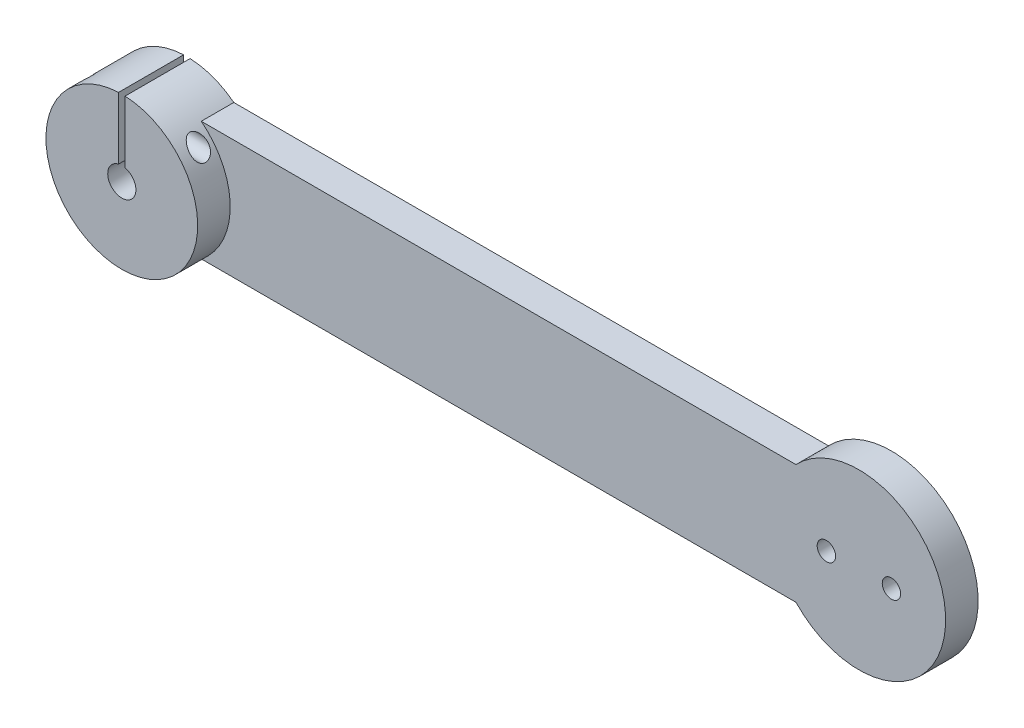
from build123d import *

# Parameters (mm, degrees)
SKETCH_1_W                         = 130
SKETCH_1_H                         = 22
ARM_WEB_L130_W22_T6_DEPTH          = 6
SKETCH_2_R                         = 14
SPLIT_CLAMP_HUB_DEPTH              = 12
SKETCH_3_R                         = 16
WRIST_END_R16_DEPTH                = 6
SHAFT_D5P2_AND_WRIST_M3_DEPTH      = 148.363496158
SHAFT_D5P2_AND_WRIST_M3_DEPTH_BACK = 148.363496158
SKETCH_4_R                         = 2.6
SKETCH_4_R_2                       = 1.7
CLAMP_SPLIT_1P2_DEPTH              = 148.363496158
CLAMP_SPLIT_1P2_DEPTH_BACK         = 148.363496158
SKETCH_5_W                         = 1.2
SKETCH_5_H                         = 12.8
CLAMP_CROSSBOLT_M3_DEPTH           = 148.363496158
CLAMP_CROSSBOLT_M3_DEPTH_BACK      = 148.363496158
SKETCH_6_R                         = 1.7


with BuildPart() as part:
    # Sketch 1 → Arm_web_L130_W22_T6 (new body)
    with BuildSketch(Plane.XY):
        with Locations((65, 0)):
            Rectangle(SKETCH_1_W, SKETCH_1_H)
    extrude(amount=ARM_WEB_L130_W22_T6_DEPTH)

    # Sketch 2 → Split_clamp_hub (add)
    with BuildSketch(Plane.XY):
        with Locations(Location((0, 0, 0), (0, 0, 308.213210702))):
            Circle(SKETCH_2_R)
    extrude(amount=SPLIT_CLAMP_HUB_DEPTH)

    # Sketch 3 → Wrist_end_R16 (add)
    with BuildSketch(Plane.XY):
        with Locations((130, 0)):
            Circle(SKETCH_3_R)
    extrude(amount=WRIST_END_R16_DEPTH)

    # Sketch 4 → Shaft_D5p2_and_wrist_M3 (cut, two sides: drawn at the far end of the back side and taken through both)
    with BuildSketch(Plane.XY.offset(-SHAFT_D5P2_AND_WRIST_M3_DEPTH_BACK)):
        Circle(SKETCH_4_R)
        with Locations((124, 0)):
            Circle(SKETCH_4_R_2)
        with Locations((136, 0)):
            Circle(SKETCH_4_R_2)
    extrude(amount=SHAFT_D5P2_AND_WRIST_M3_DEPTH + SHAFT_D5P2_AND_WRIST_M3_DEPTH_BACK, mode=Mode.SUBTRACT)

    # Sketch 5 → Clamp_split_1p2 (cut, two sides: drawn at the far end of the back side and taken through both)
    with BuildSketch(Plane.XY.offset(-CLAMP_SPLIT_1P2_DEPTH_BACK)):
        with Locations((0, 8.6)):
            Rectangle(SKETCH_5_W, SKETCH_5_H)
    extrude(amount=CLAMP_SPLIT_1P2_DEPTH + CLAMP_SPLIT_1P2_DEPTH_BACK, mode=Mode.SUBTRACT)

    # Sketch 6 → Clamp_crossbolt_M3 (cut, two sides: drawn at the far end of the back side and taken through both)
    with BuildSketch(Plane(origin=(0, 0, 0), x_dir=(0, 0, -1), z_dir=(1, 0, 0)).offset(-CLAMP_CROSSBOLT_M3_DEPTH_BACK)):
        with Locations((-8.5, 9)):
            Circle(SKETCH_6_R)
    extrude(amount=CLAMP_CROSSBOLT_M3_DEPTH + CLAMP_CROSSBOLT_M3_DEPTH_BACK, mode=Mode.SUBTRACT)


solid = part.part
